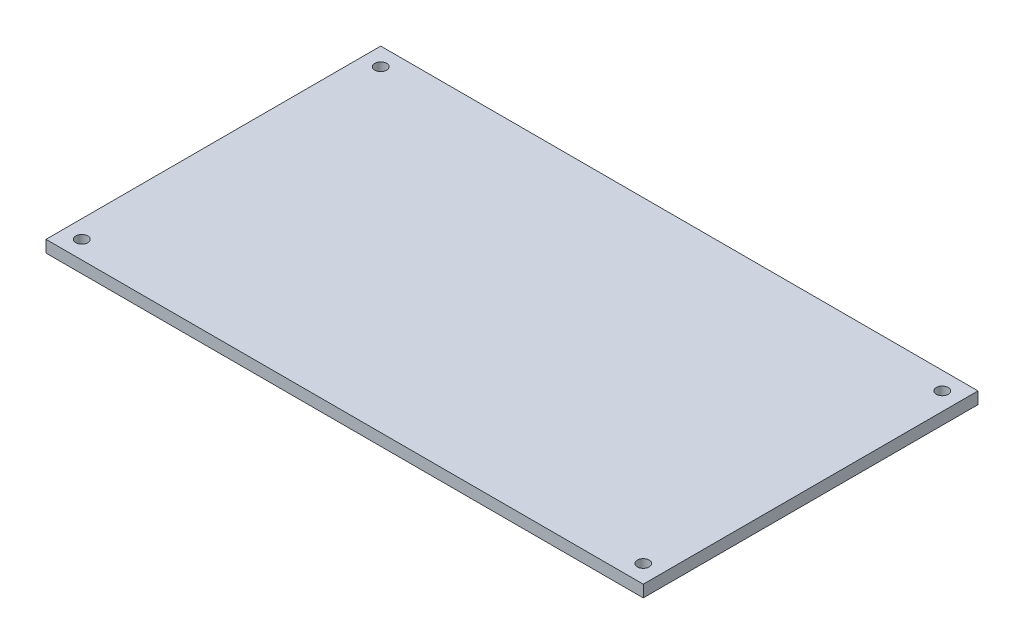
ISO-10303-21;
HEADER;
FILE_DESCRIPTION(('STEP AP214'),'2;1');
FILE_NAME('part.step','',(''),(''),'','','');
FILE_SCHEMA(('AUTOMOTIVE_DESIGN { 1 0 10303 214 1 1 1 1 }'));
ENDSEC;
DATA;
#1=APPLICATION_CONTEXT('core data for automotive mechanical design processes');
#2=APPLICATION_PROTOCOL_DEFINITION('international standard','automotive_design',2000,#1);
#3=PRODUCT_CONTEXT('',#1,'mechanical');
#4=PRODUCT('Part','Part','',(#3));
#5=PRODUCT_RELATED_PRODUCT_CATEGORY('part','',(#4));
#6=PRODUCT_DEFINITION_FORMATION('','',#4);
#7=PRODUCT_DEFINITION_CONTEXT('part definition',#1,'design');
#8=PRODUCT_DEFINITION('design','',#6,#7);
#9=PRODUCT_DEFINITION_SHAPE('','',#8);
#10=(LENGTH_UNIT() NAMED_UNIT(*) SI_UNIT(.MILLI.,.METRE.));
#11=(NAMED_UNIT(*) PLANE_ANGLE_UNIT() SI_UNIT($,.RADIAN.));
#12=(NAMED_UNIT(*) SI_UNIT($,.STERADIAN.) SOLID_ANGLE_UNIT());
#13=UNCERTAINTY_MEASURE_WITH_UNIT(LENGTH_MEASURE(1.E-05),#10,'distance_accuracy_value','');
#14=(GEOMETRIC_REPRESENTATION_CONTEXT(3) GLOBAL_UNCERTAINTY_ASSIGNED_CONTEXT((#13)) GLOBAL_UNIT_ASSIGNED_CONTEXT((#10,
#11,#12)) REPRESENTATION_CONTEXT('',''));
#15=CARTESIAN_POINT('',(0.,0.,0.));
#16=DIRECTION('',(0.,0.,1.));
#17=DIRECTION('',(1.,0.,0.));
#18=AXIS2_PLACEMENT_3D('',#15,#16,#17);
#19=CARTESIAN_POINT('',(0.,2.,0.));
#20=DIRECTION('',(0.,-1.,0.));
#21=DIRECTION('',(0.,0.,-1.));
#22=AXIS2_PLACEMENT_3D('',#19,#20,#21);
#23=PLANE('',#22);
#24=DIRECTION('',(0.,0.,1.));
#25=VECTOR('',#24,1.);
#26=CARTESIAN_POINT('',(0.,2.,0.));
#27=LINE('',#26,#25);
#28=CARTESIAN_POINT('',(0.,2.,-56.1));
#29=VERTEX_POINT('',#28);
#30=CARTESIAN_POINT('',(0.,2.,0.));
#31=VERTEX_POINT('',#30);
#32=EDGE_CURVE('E84',#29,#31,#27,.T.);
#33=ORIENTED_EDGE('',*,*,#32,.T.);
#34=DIRECTION('',(1.,0.,0.));
#35=VECTOR('',#34,1.);
#36=CARTESIAN_POINT('',(0.,2.,0.));
#37=LINE('',#36,#35);
#38=CARTESIAN_POINT('',(100.1,2.,0.));
#39=VERTEX_POINT('',#38);
#40=EDGE_CURVE('E79',#31,#39,#37,.T.);
#41=ORIENTED_EDGE('',*,*,#40,.T.);
#42=DIRECTION('',(0.,0.,-1.));
#43=VECTOR('',#42,1.);
#44=CARTESIAN_POINT('',(100.1,2.,0.));
#45=LINE('',#44,#43);
#46=CARTESIAN_POINT('',(100.1,2.,-56.1));
#47=VERTEX_POINT('',#46);
#48=EDGE_CURVE('E82',#39,#47,#45,.T.);
#49=ORIENTED_EDGE('',*,*,#48,.T.);
#50=DIRECTION('',(-1.,0.,0.));
#51=VECTOR('',#50,1.);
#52=CARTESIAN_POINT('',(0.,2.,-56.1));
#53=LINE('',#52,#51);
#54=EDGE_CURVE('E49',#47,#29,#53,.T.);
#55=ORIENTED_EDGE('',*,*,#54,.T.);
#56=EDGE_LOOP('',(#33,#41,#49,#55));
#57=FACE_BOUND('',#56,.T.);
#58=CARTESIAN_POINT('',(3.,2.,-53.1));
#59=DIRECTION('',(0.,1.,0.));
#60=DIRECTION('',(0.,0.,1.));
#61=AXIS2_PLACEMENT_3D('',#58,#59,#60);
#62=CIRCLE('',#61,1.);
#63=CARTESIAN_POINT('',(3.,2.,-52.1));
#64=VERTEX_POINT('',#63);
#65=EDGE_CURVE('E99',#64,#64,#62,.T.);
#66=ORIENTED_EDGE('',*,*,#65,.F.);
#67=EDGE_LOOP('',(#66));
#68=FACE_BOUND('',#67,.T.);
#69=CARTESIAN_POINT('',(97.1,2.,-53.1));
#70=DIRECTION('',(0.,1.,0.));
#71=DIRECTION('',(0.,0.,1.));
#72=AXIS2_PLACEMENT_3D('',#69,#70,#71);
#73=CIRCLE('',#72,0.999999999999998);
#74=CARTESIAN_POINT('',(97.1,2.,-52.1));
#75=VERTEX_POINT('',#74);
#76=EDGE_CURVE('E114',#75,#75,#73,.T.);
#77=ORIENTED_EDGE('',*,*,#76,.F.);
#78=EDGE_LOOP('',(#77));
#79=FACE_BOUND('',#78,.T.);
#80=CARTESIAN_POINT('',(97.1,2.,-3.));
#81=DIRECTION('',(0.,1.,0.));
#82=DIRECTION('',(0.,0.,1.));
#83=AXIS2_PLACEMENT_3D('',#80,#81,#82);
#84=CIRCLE('',#83,0.999999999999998);
#85=CARTESIAN_POINT('',(97.1,2.,-2.));
#86=VERTEX_POINT('',#85);
#87=EDGE_CURVE('E120',#86,#86,#84,.T.);
#88=ORIENTED_EDGE('',*,*,#87,.F.);
#89=EDGE_LOOP('',(#88));
#90=FACE_BOUND('',#89,.T.);
#91=CARTESIAN_POINT('',(3.,2.,-3.));
#92=DIRECTION('',(0.,1.,0.));
#93=DIRECTION('',(0.,0.,1.));
#94=AXIS2_PLACEMENT_3D('',#91,#92,#93);
#95=CIRCLE('',#94,1.);
#96=CARTESIAN_POINT('',(3.,2.,-2.));
#97=VERTEX_POINT('',#96);
#98=EDGE_CURVE('E126',#97,#97,#95,.T.);
#99=ORIENTED_EDGE('',*,*,#98,.F.);
#100=EDGE_LOOP('',(#99));
#101=FACE_BOUND('',#100,.T.);
#102=ADVANCED_FACE('F32',(#57,#68,#79,#90,#101),#23,.F.);
#103=CARTESIAN_POINT('',(0.,0.,0.));
#104=DIRECTION('',(0.,-1.,0.));
#105=DIRECTION('',(0.,0.,-1.));
#106=AXIS2_PLACEMENT_3D('',#103,#104,#105);
#107=PLANE('',#106);
#108=CARTESIAN_POINT('',(97.1,0.,-3.));
#109=DIRECTION('',(0.,1.,0.));
#110=DIRECTION('',(0.,0.,1.));
#111=AXIS2_PLACEMENT_3D('',#108,#109,#110);
#112=CIRCLE('',#111,0.999999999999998);
#113=CARTESIAN_POINT('',(97.1,0.,-2.));
#114=VERTEX_POINT('',#113);
#115=EDGE_CURVE('E123',#114,#114,#112,.T.);
#116=ORIENTED_EDGE('',*,*,#115,.T.);
#117=EDGE_LOOP('',(#116));
#118=FACE_BOUND('',#117,.T.);
#119=CARTESIAN_POINT('',(3.,0.,-53.1));
#120=DIRECTION('',(0.,1.,0.));
#121=DIRECTION('',(0.,0.,1.));
#122=AXIS2_PLACEMENT_3D('',#119,#120,#121);
#123=CIRCLE('',#122,1.);
#124=CARTESIAN_POINT('',(3.,0.,-52.1));
#125=VERTEX_POINT('',#124);
#126=EDGE_CURVE('E111',#125,#125,#123,.T.);
#127=ORIENTED_EDGE('',*,*,#126,.T.);
#128=EDGE_LOOP('',(#127));
#129=FACE_BOUND('',#128,.T.);
#130=DIRECTION('',(0.,0.,1.));
#131=VECTOR('',#130,1.);
#132=CARTESIAN_POINT('',(0.,0.,0.));
#133=LINE('',#132,#131);
#134=CARTESIAN_POINT('',(0.,0.,-56.1));
#135=VERTEX_POINT('',#134);
#136=CARTESIAN_POINT('',(0.,0.,0.));
#137=VERTEX_POINT('',#136);
#138=EDGE_CURVE('E96',#135,#137,#133,.T.);
#139=ORIENTED_EDGE('',*,*,#138,.F.);
#140=DIRECTION('',(-1.,0.,0.));
#141=VECTOR('',#140,1.);
#142=CARTESIAN_POINT('',(0.,0.,-56.1));
#143=LINE('',#142,#141);
#144=CARTESIAN_POINT('',(100.1,0.,-56.1));
#145=VERTEX_POINT('',#144);
#146=EDGE_CURVE('E72',#145,#135,#143,.T.);
#147=ORIENTED_EDGE('',*,*,#146,.F.);
#148=DIRECTION('',(0.,0.,-1.));
#149=VECTOR('',#148,1.);
#150=CARTESIAN_POINT('',(100.1,0.,0.));
#151=LINE('',#150,#149);
#152=CARTESIAN_POINT('',(100.1,0.,0.));
#153=VERTEX_POINT('',#152);
#154=EDGE_CURVE('E66',#153,#145,#151,.T.);
#155=ORIENTED_EDGE('',*,*,#154,.F.);
#156=DIRECTION('',(1.,0.,0.));
#157=VECTOR('',#156,1.);
#158=CARTESIAN_POINT('',(0.,0.,0.));
#159=LINE('',#158,#157);
#160=EDGE_CURVE('E88',#137,#153,#159,.T.);
#161=ORIENTED_EDGE('',*,*,#160,.F.);
#162=EDGE_LOOP('',(#139,#147,#155,#161));
#163=FACE_BOUND('',#162,.T.);
#164=CARTESIAN_POINT('',(97.1,0.,-53.1));
#165=DIRECTION('',(0.,1.,0.));
#166=DIRECTION('',(0.,0.,1.));
#167=AXIS2_PLACEMENT_3D('',#164,#165,#166);
#168=CIRCLE('',#167,0.999999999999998);
#169=CARTESIAN_POINT('',(97.1,0.,-52.1));
#170=VERTEX_POINT('',#169);
#171=EDGE_CURVE('E117',#170,#170,#168,.T.);
#172=ORIENTED_EDGE('',*,*,#171,.T.);
#173=EDGE_LOOP('',(#172));
#174=FACE_BOUND('',#173,.T.);
#175=CARTESIAN_POINT('',(3.,0.,-3.));
#176=DIRECTION('',(0.,1.,0.));
#177=DIRECTION('',(0.,0.,1.));
#178=AXIS2_PLACEMENT_3D('',#175,#176,#177);
#179=CIRCLE('',#178,1.);
#180=CARTESIAN_POINT('',(3.,0.,-2.));
#181=VERTEX_POINT('',#180);
#182=EDGE_CURVE('E129',#181,#181,#179,.T.);
#183=ORIENTED_EDGE('',*,*,#182,.T.);
#184=EDGE_LOOP('',(#183));
#185=FACE_BOUND('',#184,.T.);
#186=ADVANCED_FACE('F107',(#118,#129,#163,#174,#185),#107,.T.);
#187=CARTESIAN_POINT('',(0.,2.,0.));
#188=DIRECTION('',(1.,0.,0.));
#189=DIRECTION('',(0.,0.,-1.));
#190=AXIS2_PLACEMENT_3D('',#187,#188,#189);
#191=PLANE('',#190);
#192=ORIENTED_EDGE('',*,*,#138,.T.);
#193=DIRECTION('',(0.,-1.,0.));
#194=VECTOR('',#193,1.);
#195=CARTESIAN_POINT('',(0.,2.,0.));
#196=LINE('',#195,#194);
#197=EDGE_CURVE('E11',#31,#137,#196,.T.);
#198=ORIENTED_EDGE('',*,*,#197,.F.);
#199=ORIENTED_EDGE('',*,*,#32,.F.);
#200=DIRECTION('',(0.,-1.,0.));
#201=VECTOR('',#200,1.);
#202=CARTESIAN_POINT('',(0.,2.,-56.1));
#203=LINE('',#202,#201);
#204=EDGE_CURVE('E92',#29,#135,#203,.T.);
#205=ORIENTED_EDGE('',*,*,#204,.T.);
#206=EDGE_LOOP('',(#192,#198,#199,#205));
#207=FACE_BOUND('',#206,.T.);
#208=ADVANCED_FACE('F34',(#207),#191,.F.);
#209=CARTESIAN_POINT('',(0.,2.,0.));
#210=DIRECTION('',(0.,0.,-1.));
#211=DIRECTION('',(-1.,0.,0.));
#212=AXIS2_PLACEMENT_3D('',#209,#210,#211);
#213=PLANE('',#212);
#214=ORIENTED_EDGE('',*,*,#160,.T.);
#215=DIRECTION('',(0.,-1.,0.));
#216=VECTOR('',#215,1.);
#217=CARTESIAN_POINT('',(100.1,2.,0.));
#218=LINE('',#217,#216);
#219=EDGE_CURVE('E41',#39,#153,#218,.T.);
#220=ORIENTED_EDGE('',*,*,#219,.F.);
#221=ORIENTED_EDGE('',*,*,#40,.F.);
#222=ORIENTED_EDGE('',*,*,#197,.T.);
#223=EDGE_LOOP('',(#214,#220,#221,#222));
#224=FACE_BOUND('',#223,.T.);
#225=ADVANCED_FACE('F87',(#224),#213,.F.);
#226=CARTESIAN_POINT('',(100.1,2.,0.));
#227=DIRECTION('',(-1.,0.,0.));
#228=DIRECTION('',(0.,0.,1.));
#229=AXIS2_PLACEMENT_3D('',#226,#227,#228);
#230=PLANE('',#229);
#231=ORIENTED_EDGE('',*,*,#154,.T.);
#232=DIRECTION('',(0.,-1.,0.));
#233=VECTOR('',#232,1.);
#234=CARTESIAN_POINT('',(100.1,2.,-56.1));
#235=LINE('',#234,#233);
#236=EDGE_CURVE('E89',#47,#145,#235,.T.);
#237=ORIENTED_EDGE('',*,*,#236,.F.);
#238=ORIENTED_EDGE('',*,*,#48,.F.);
#239=ORIENTED_EDGE('',*,*,#219,.T.);
#240=EDGE_LOOP('',(#231,#237,#238,#239));
#241=FACE_BOUND('',#240,.T.);
#242=ADVANCED_FACE('F90',(#241),#230,.F.);
#243=CARTESIAN_POINT('',(0.,2.,-56.1));
#244=DIRECTION('',(0.,0.,1.));
#245=DIRECTION('',(1.,0.,0.));
#246=AXIS2_PLACEMENT_3D('',#243,#244,#245);
#247=PLANE('',#246);
#248=ORIENTED_EDGE('',*,*,#146,.T.);
#249=ORIENTED_EDGE('',*,*,#204,.F.);
#250=ORIENTED_EDGE('',*,*,#54,.F.);
#251=ORIENTED_EDGE('',*,*,#236,.T.);
#252=EDGE_LOOP('',(#248,#249,#250,#251));
#253=FACE_BOUND('',#252,.T.);
#254=ADVANCED_FACE('F104',(#253),#247,.F.);
#255=CARTESIAN_POINT('',(3.,2.,-53.1));
#256=DIRECTION('',(0.,-1.,0.));
#257=DIRECTION('',(0.,0.,-1.));
#258=AXIS2_PLACEMENT_3D('',#255,#256,#257);
#259=CYLINDRICAL_SURFACE('',#258,1.);
#260=ORIENTED_EDGE('',*,*,#65,.T.);
#261=EDGE_LOOP('',(#260));
#262=FACE_BOUND('',#261,.T.);
#263=ORIENTED_EDGE('',*,*,#126,.F.);
#264=EDGE_LOOP('',(#263));
#265=FACE_BOUND('',#264,.T.);
#266=ADVANCED_FACE('F146',(#262,#265),#259,.F.);
#267=CARTESIAN_POINT('',(97.1,2.,-53.1));
#268=DIRECTION('',(0.,-1.,0.));
#269=DIRECTION('',(0.,0.,-1.));
#270=AXIS2_PLACEMENT_3D('',#267,#268,#269);
#271=CYLINDRICAL_SURFACE('',#270,0.999999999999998);
#272=ORIENTED_EDGE('',*,*,#76,.T.);
#273=EDGE_LOOP('',(#272));
#274=FACE_BOUND('',#273,.T.);
#275=ORIENTED_EDGE('',*,*,#171,.F.);
#276=EDGE_LOOP('',(#275));
#277=FACE_BOUND('',#276,.T.);
#278=ADVANCED_FACE('F192',(#274,#277),#271,.F.);
#279=CARTESIAN_POINT('',(97.1,2.,-3.));
#280=DIRECTION('',(0.,-1.,0.));
#281=DIRECTION('',(0.,0.,-1.));
#282=AXIS2_PLACEMENT_3D('',#279,#280,#281);
#283=CYLINDRICAL_SURFACE('',#282,0.999999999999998);
#284=ORIENTED_EDGE('',*,*,#87,.T.);
#285=EDGE_LOOP('',(#284));
#286=FACE_BOUND('',#285,.T.);
#287=ORIENTED_EDGE('',*,*,#115,.F.);
#288=EDGE_LOOP('',(#287));
#289=FACE_BOUND('',#288,.T.);
#290=ADVANCED_FACE('F200',(#286,#289),#283,.F.);
#291=CARTESIAN_POINT('',(3.,2.,-3.));
#292=DIRECTION('',(0.,-1.,0.));
#293=DIRECTION('',(0.,0.,-1.));
#294=AXIS2_PLACEMENT_3D('',#291,#292,#293);
#295=CYLINDRICAL_SURFACE('',#294,1.);
#296=ORIENTED_EDGE('',*,*,#98,.T.);
#297=EDGE_LOOP('',(#296));
#298=FACE_BOUND('',#297,.T.);
#299=ORIENTED_EDGE('',*,*,#182,.F.);
#300=EDGE_LOOP('',(#299));
#301=FACE_BOUND('',#300,.T.);
#302=ADVANCED_FACE('F135',(#298,#301),#295,.F.);
#303=CLOSED_SHELL('',(#102,#186,#208,#225,#242,#254,#266,#278,#290,#302));
#304=MANIFOLD_SOLID_BREP('B2',#303);
#305=ADVANCED_BREP_SHAPE_REPRESENTATION('',(#18,#304),#14);
#306=SHAPE_DEFINITION_REPRESENTATION(#9,#305);
ENDSEC;
END-ISO-10303-21;
